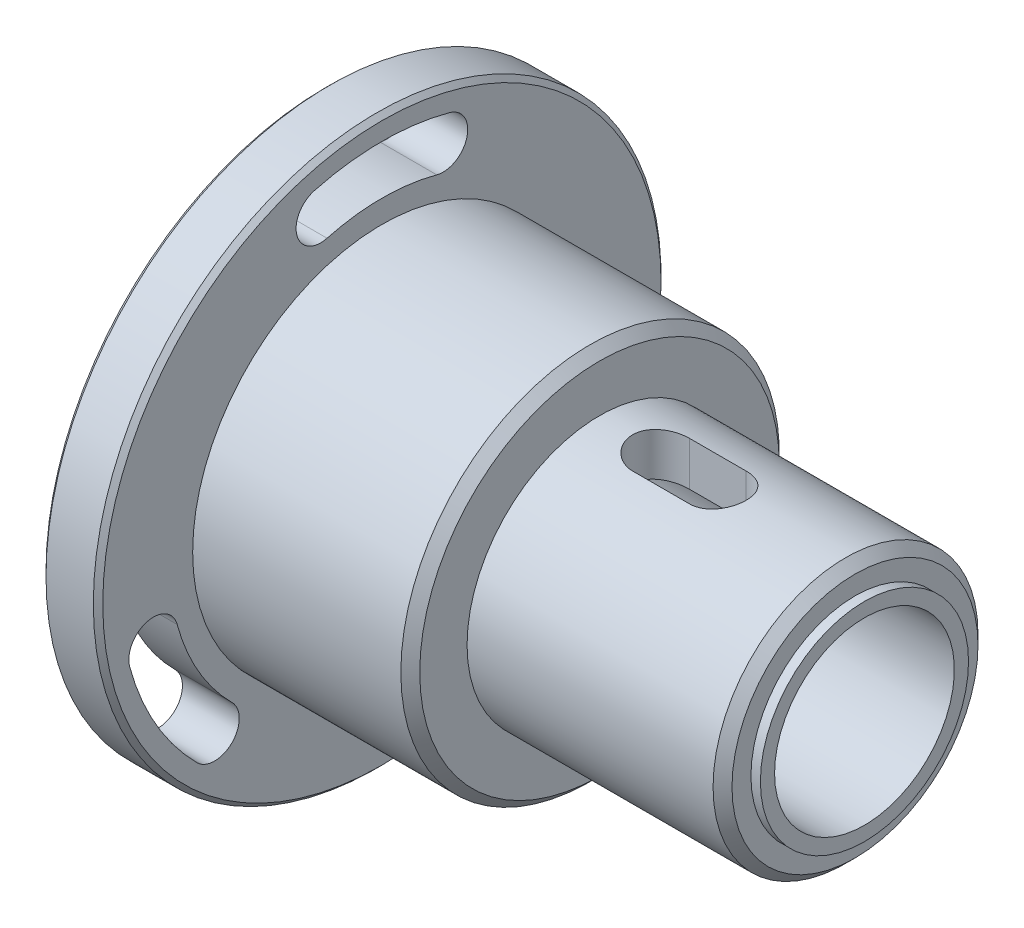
from build123d import *

# Parameters (mm, degrees)
LINEAR_AUSTRAGEN1_DEPTH = 74.484692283
LINEAR_AUSTRAGEN2_DEPTH = 72.056315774
KREISMUSTER1_COUNT      = 3
FASE1_SIZE              = 1
FASE2_SIZE              = 1
FASE3_SIZE              = 0.5


with BuildPart() as part:
    # Skizze2 → Rotation1 (revolve)
    with BuildSketch(Plane.XY, mode=Mode.PRIVATE) as rotation1_sk:
        Polygon((0, 20), (0, 14), (14, 14), (15, 14), (15, 11), (14, 11), (14, 9.5), (60, 9.5), (60, 11), (59, 11), (59, 14), (32, 14), (32, 20), (9, 20), (9, 30), (3, 30), (3, 20), align=None)
    revolve(rotation1_sk.sketch.rotate(Axis((0, 0, 0), (1, 0, 0)), 90), axis=Axis((0, 0, 0), (1, 0, 0)))

    # Skizze3 → Linear austragen1 (cut, through all)
    with BuildSketch(Plane(origin=(0, 0, 0), x_dir=(1, 0, 0), z_dir=(0, 1, 0))):
        with BuildLine():
            Line((38.5, -3), (44.5, -3))
            ThreePointArc((44.5, -3), (47.5, 0), (44.5, 3))
            Line((44.5, 3), (38.5, 3))
            ThreePointArc((38.5, 3), (35.5, 0), (38.5, -3))
        make_face()
    extrude(amount=LINEAR_AUSTRAGEN1_DEPTH, mode=Mode.SUBTRACT)

    # Skizze4 → Linear austragen2 (cut, through all)
    with BuildSketch(Plane.ZY.offset(-3)):
        with BuildLine():
            ThreePointArc((-5.79754661, 21.636738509), (0, 22.4), (5.79754661, 21.636738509))
            ThreePointArc((5.79754661, 21.636738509), (8.981883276, 23.47521614), (7.143405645, 26.659552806))
            ThreePointArc((7.143405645, 26.659552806), (0, 27.6), (-7.143405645, 26.659552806))
            ThreePointArc((-7.143405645, 26.659552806), (-8.981883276, 23.47521614), (-5.79754661, 21.636738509))
        make_face()
    linear_austragen2 = extrude(amount=-LINEAR_AUSTRAGEN2_DEPTH, mode=Mode.SUBTRACT)

    # Kreismuster1: Linear austragen2 ×3 about axis
    kreismuster1_axis = Axis((0, 0, 0), (1, 0, 0))
    for i in range(1, KREISMUSTER1_COUNT):
        add(linear_austragen2.rotate(kreismuster1_axis, i * 360 / KREISMUSTER1_COUNT), mode=Mode.SUBTRACT)

    # Fase1
    fase1_edges = [part.edges().sort_by_distance(p)[0] for p in [
        (59, 0, -14),
    ]]
    chamfer(fase1_edges, length=FASE1_SIZE)

    # Fase2
    fase2_edges = [part.edges().sort_by_distance(p)[0] for p in [
        (32, 0, -20),
    ]]
    chamfer(fase2_edges, length=FASE2_SIZE)

    # Fase3
    fase3_edges = [part.edges().sort_by_distance(p)[0] for p in [
        (0, 0, -20),
        (3, 0, -30),
        (9, 0, -30),
    ]]
    chamfer(fase3_edges, length=FASE3_SIZE)


solid = part.part
